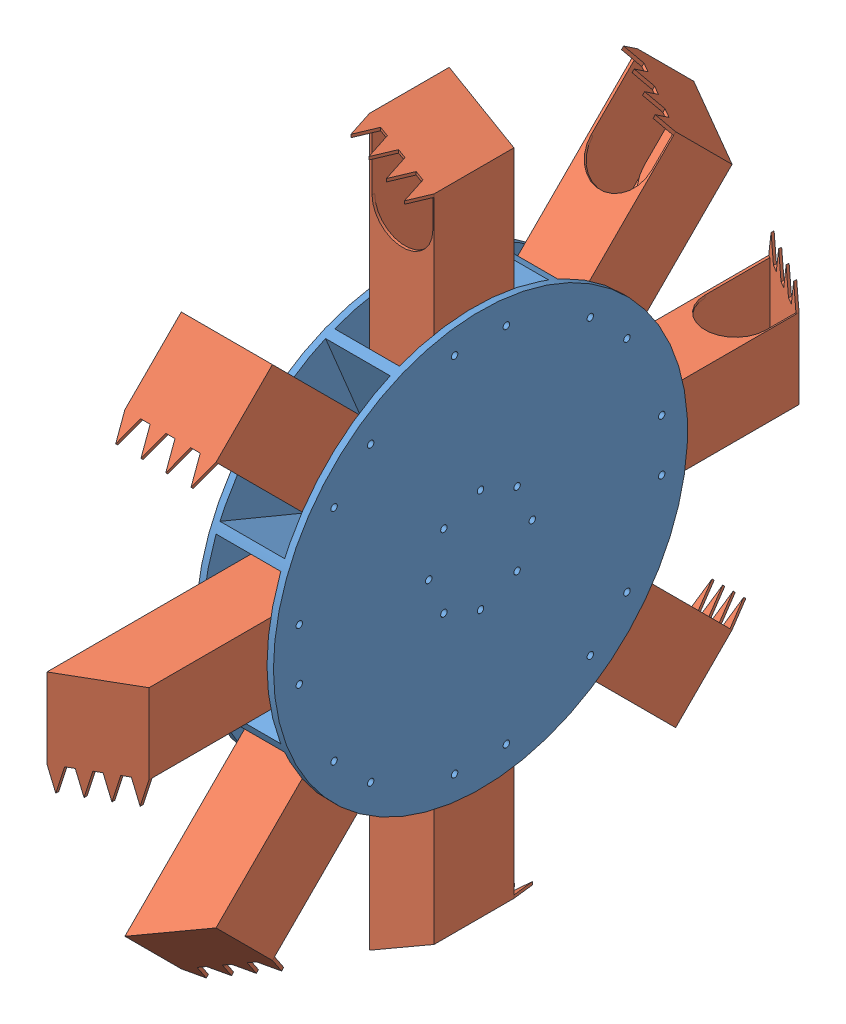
SolidWorks assembly ExcavatorAssembly.SLDASM, configuration Default (file format 12000). Lengths in mm.
Overall size (76.2 711.2 711.2).
9 component instances, 2 part files, 3 mates.
Components (placement in the parent):
- ExcavatorBase-1: ExcavatorBase.SLDPRT [Default] at (129.0641 250.4236 297.8416) size (76.2 406.4 406.4)
- ExcavatorBucket8-1: ExcavatorBucket8.SLDPRT [Default] at (198.9141 252.3857 318.781) x (0 -1 0) z (-1 0 0) size (101.98 355.6 63.5)
- ExcavatorBucket8-2: ExcavatorBucket8.SLDPRT [Default] at (198.9141 266.6173 311.2605) x (0 -0.707107 0.707107) z (-1 0 0) size (101.98 355.6 63.5)
- ExcavatorBucket8-3: ExcavatorBucket8.SLDPRT [Default] at (198.9141 271.3629 295.8795) x (0 0 1) z (-1 0 0) size (101.98 355.6 63.5)
- ExcavatorBucket8-4: ExcavatorBucket8.SLDPRT [Default] at (198.9141 263.8425 281.6479) x (0 0.707107 0.707107) z (-1 0 0) size (101.98 355.6 63.5)
- ExcavatorBucket8-5: ExcavatorBucket8.SLDPRT [Default] at (198.9141 248.4614 276.9023) x (0 1 0) z (-1 0 0) size (101.98 355.6 63.5)
- ExcavatorBucket8-6: ExcavatorBucket8.SLDPRT [Default] at (198.9141 234.2298 284.4228) x (0 0.707107 -0.707107) z (-1 0 0) size (101.98 355.6 63.5)
- ExcavatorBucket8-7: ExcavatorBucket8.SLDPRT [Default] at (198.9141 229.4843 299.8038) x (0 0 -1) z (-1 0 0) size (101.98 355.6 63.5)
- ExcavatorBucket8-8: ExcavatorBucket8.SLDPRT [Default] at (198.9141 237.0047 314.0354) x (0 -0.707107 -0.707107) z (-1 0 0) size (101.98 355.6 63.5)
Mates (geometry in assembly coordinates):
- Concentric1: concentric anti-aligned: cylinder of ExcavatorBase-1 through (129.0641 250.4236 399.4416) axis (1 0 0) radius 31.75; circle of ExcavatorBucket8-1
- Coincident2: coincident anti-aligned: plane of ExcavatorBase-1 through (198.9141 250.4236 297.8416) normal (-1 0 0); plane of ExcavatorBucket8-1 through (198.9141 250.4236 399.4416) normal (1 0 0)
- Concentric2: concentric aligned: cylinder of ExcavatorBase-1 through (129.0641 250.4236 348.6416) axis (1 0 0) radius 3.175; cylinder of ExcavatorBucket8-1 through (135.4141 250.4236 348.6416) axis (1 0 0) radius 3.175
